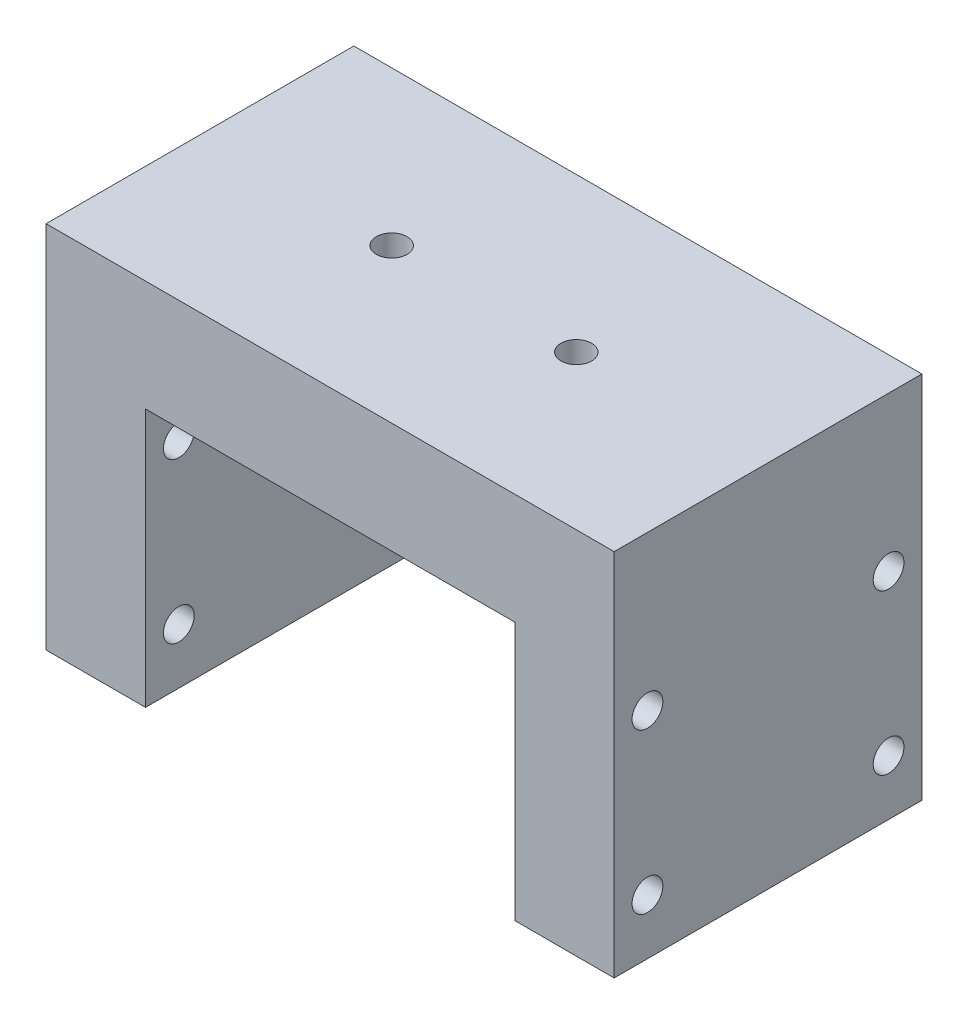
from build123d import *

# Parameters (mm, degrees)
BOSS_EXTRUDE1_DEPTH       = 12.5
M3X0_5_TAPPED_HOLE1_D     = 2.5
M3X0_5_TAPPED_HOLE1_DEPTH = 10
M3X0_5_TAPPED_HOLE1_TIP   = 0.751075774
F_2_5MM_DOWEL_HOLE1_D     = 2.5


with BuildPart() as part:
    # Sketch2 → Boss-Extrude1 (new, symmetric)
    with BuildSketch(Plane.XY):
        Polygon((-23.075, -21), (-23.075, 9), (23.075, 9), (23.075, -21), (15, -21), (15, 0), (-15, 0), (-15, -21), align=None)
    extrude(amount=BOSS_EXTRUDE1_DEPTH, both=True)

    # M3x0.5 Tapped Hole1
    with Locations(Plane(origin=(0, 9, 0), x_dir=(1, 0, 0), z_dir=(0, 1, 0))):
        with Locations((-7.5, 0), (7.5, 0)):
            Hole(M3X0_5_TAPPED_HOLE1_D / 2, depth=M3X0_5_TAPPED_HOLE1_DEPTH)
            with Locations((0, 0, -(M3X0_5_TAPPED_HOLE1_DEPTH + M3X0_5_TAPPED_HOLE1_TIP / 2))):  # 118° drill point
                Cone(0, M3X0_5_TAPPED_HOLE1_D / 2, M3X0_5_TAPPED_HOLE1_TIP, mode=Mode.SUBTRACT)

    # 2.5mm Dowel Hole1 (through all)
    with Locations(Plane.ZY.offset(23.075)):
        with Locations((-9.795, -3.53), (9.795, -16.5), (-9.795, -16.5), (9.795, -3.53)):
            Hole(F_2_5MM_DOWEL_HOLE1_D / 2)


solid = part.part
